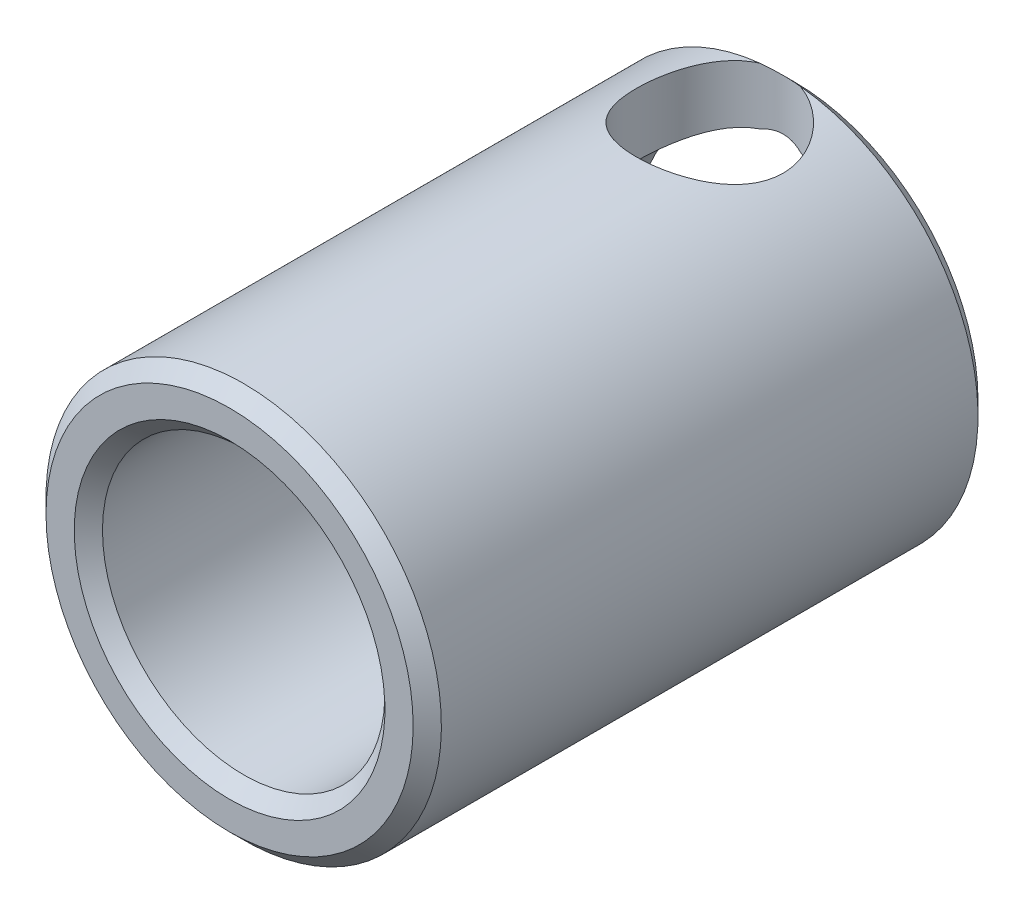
ISO-10303-21;
HEADER;
FILE_DESCRIPTION(('STEP AP214'),'2;1');
FILE_NAME('part.step','',(''),(''),'','','');
FILE_SCHEMA(('AUTOMOTIVE_DESIGN { 1 0 10303 214 1 1 1 1 }'));
ENDSEC;
DATA;
#1=APPLICATION_CONTEXT('core data for automotive mechanical design processes');
#2=APPLICATION_PROTOCOL_DEFINITION('international standard','automotive_design',2000,#1);
#3=PRODUCT_CONTEXT('',#1,'mechanical');
#4=PRODUCT('Part','Part','',(#3));
#5=PRODUCT_RELATED_PRODUCT_CATEGORY('part','',(#4));
#6=PRODUCT_DEFINITION_FORMATION('','',#4);
#7=PRODUCT_DEFINITION_CONTEXT('part definition',#1,'design');
#8=PRODUCT_DEFINITION('design','',#6,#7);
#9=PRODUCT_DEFINITION_SHAPE('','',#8);
#10=(LENGTH_UNIT() NAMED_UNIT(*) SI_UNIT(.MILLI.,.METRE.));
#11=(NAMED_UNIT(*) PLANE_ANGLE_UNIT() SI_UNIT($,.RADIAN.));
#12=(NAMED_UNIT(*) SI_UNIT($,.STERADIAN.) SOLID_ANGLE_UNIT());
#13=UNCERTAINTY_MEASURE_WITH_UNIT(LENGTH_MEASURE(1.E-05),#10,'distance_accuracy_value','');
#14=(GEOMETRIC_REPRESENTATION_CONTEXT(3) GLOBAL_UNCERTAINTY_ASSIGNED_CONTEXT((#13)) GLOBAL_UNIT_ASSIGNED_CONTEXT((#10,
#11,#12)) REPRESENTATION_CONTEXT('',''));
#15=CARTESIAN_POINT('',(0.,0.,0.));
#16=DIRECTION('',(0.,0.,1.));
#17=DIRECTION('',(1.,0.,0.));
#18=AXIS2_PLACEMENT_3D('',#15,#16,#17);
#19=CARTESIAN_POINT('',(0.,0.,20.));
#20=DIRECTION('',(0.,0.,-1.));
#21=DIRECTION('',(-1.,0.,0.));
#22=AXIS2_PLACEMENT_3D('',#19,#20,#21);
#23=CYLINDRICAL_SURFACE('',#22,7.);
#24=CARTESIAN_POINT('',(0.,0.,19.5));
#25=DIRECTION('',(0.,0.,1.));
#26=DIRECTION('',(0.,1.,0.));
#27=AXIS2_PLACEMENT_3D('',#24,#25,#26);
#28=CIRCLE('',#27,7.);
#29=CARTESIAN_POINT('',(0.,7.,19.5));
#30=VERTEX_POINT('',#29);
#31=EDGE_CURVE('E9',#30,#30,#28,.F.);
#32=ORIENTED_EDGE('',*,*,#31,.T.);
#33=EDGE_LOOP('',(#32));
#34=FACE_BOUND('',#33,.T.);
#35=CARTESIAN_POINT('',(0.,7.,0.4));
#36=CARTESIAN_POINT('',(0.140902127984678,7.00000340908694,0.399995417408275));
#37=CARTESIAN_POINT('',(0.281772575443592,6.99570847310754,0.411489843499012));
#38=CARTESIAN_POINT('',(0.559308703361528,6.97900377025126,0.456981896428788));
#39=CARTESIAN_POINT('',(0.69597489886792,6.96659500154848,0.490976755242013));
#40=CARTESIAN_POINT('',(0.961060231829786,6.93499607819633,0.580105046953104));
#41=CARTESIAN_POINT('',(1.08949454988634,6.9158188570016,0.635198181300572));
#42=CARTESIAN_POINT('',(1.33529005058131,6.87259728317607,0.764756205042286));
#43=CARTESIAN_POINT('',(1.45264831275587,6.84855165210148,0.839226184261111));
#44=CARTESIAN_POINT('',(1.67786429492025,6.79695712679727,1.00867578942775));
#45=CARTESIAN_POINT('',(1.78519764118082,6.76931039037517,1.10432230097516));
#46=CARTESIAN_POINT('',(1.98272113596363,6.71411603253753,1.31199410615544));
#47=CARTESIAN_POINT('',(2.07290618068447,6.68656844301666,1.42402425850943));
#48=CARTESIAN_POINT('',(2.23687620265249,6.63355869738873,1.66637033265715));
#49=CARTESIAN_POINT('',(2.309925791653,6.6082123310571,1.79721167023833));
#50=CARTESIAN_POINT('',(2.43275023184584,6.56399417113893,2.07041309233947));
#51=CARTESIAN_POINT('',(2.48253417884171,6.54511984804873,2.21276864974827));
#52=CARTESIAN_POINT('',(2.5553531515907,6.51702746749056,2.49892679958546));
#53=CARTESIAN_POINT('',(2.57938744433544,6.50745015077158,2.64243866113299));
#54=CARTESIAN_POINT('',(2.60314935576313,6.49798380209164,2.93175348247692));
#55=CARTESIAN_POINT('',(2.60288677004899,6.49809086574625,3.07755549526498));
#56=CARTESIAN_POINT('',(2.57882752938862,6.50767095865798,3.35822753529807));
#57=CARTESIAN_POINT('',(2.55640932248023,6.51659539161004,3.49323790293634));
#58=CARTESIAN_POINT('',(2.49095130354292,6.54189421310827,3.75742220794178));
#59=CARTESIAN_POINT('',(2.44790844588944,6.55826970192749,3.88659528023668));
#60=CARTESIAN_POINT('',(2.34165335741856,6.59696112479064,4.13827617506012));
#61=CARTESIAN_POINT('',(2.27807915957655,6.61938237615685,4.26061427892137));
#62=CARTESIAN_POINT('',(2.13281821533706,6.6676031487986,4.49328919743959));
#63=CARTESIAN_POINT('',(2.05112529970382,6.69340381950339,4.60362190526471));
#64=CARTESIAN_POINT('',(1.86561162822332,6.74754880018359,4.81679505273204));
#65=CARTESIAN_POINT('',(1.76068817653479,6.7759487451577,4.9186640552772));
#66=CARTESIAN_POINT('',(1.5349179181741,6.83062982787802,5.10364628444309));
#67=CARTESIAN_POINT('',(1.41406876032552,6.8569106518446,5.18675673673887));
#68=CARTESIAN_POINT('',(1.15743751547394,6.90489731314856,5.3329069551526));
#69=CARTESIAN_POINT('',(1.02145960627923,6.92652907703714,5.39562891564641));
#70=CARTESIAN_POINT('',(0.739879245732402,6.96223204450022,5.49698648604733));
#71=CARTESIAN_POINT('',(0.594281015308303,6.9763065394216,5.5356325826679));
#72=CARTESIAN_POINT('',(0.305773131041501,6.99473357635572,5.58588709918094));
#73=CARTESIAN_POINT('',(0.163121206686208,6.99955613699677,5.59880404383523));
#74=CARTESIAN_POINT('',(-0.122376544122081,7.00038457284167,5.60103632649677));
#75=CARTESIAN_POINT('',(-0.265222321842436,6.99639235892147,5.59035677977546));
#76=CARTESIAN_POINT('',(-0.541435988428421,6.98035004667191,5.54669781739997));
#77=CARTESIAN_POINT('',(-0.674958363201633,6.96860812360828,5.51457074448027));
#78=CARTESIAN_POINT('',(-0.934627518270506,6.93855669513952,5.43004585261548));
#79=CARTESIAN_POINT('',(-1.06077333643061,6.92024633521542,5.37764539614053));
#80=CARTESIAN_POINT('',(-1.30622972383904,6.87820684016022,5.25239914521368));
#81=CARTESIAN_POINT('',(-1.42523360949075,6.85433523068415,5.17900159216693));
#82=CARTESIAN_POINT('',(-1.64963112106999,6.80382009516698,5.01447034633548));
#83=CARTESIAN_POINT('',(-1.75501976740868,6.77717556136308,4.9233301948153));
#84=CARTESIAN_POINT('',(-1.95546470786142,6.72217031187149,4.71979576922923));
#85=CARTESIAN_POINT('',(-2.04959193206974,6.69379820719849,4.60648723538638));
#86=CARTESIAN_POINT('',(-2.21767356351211,6.64001014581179,4.36511926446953));
#87=CARTESIAN_POINT('',(-2.29162634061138,6.61459442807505,4.23705863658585));
#88=CARTESIAN_POINT('',(-2.41728845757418,6.56971904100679,3.96887010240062));
#89=CARTESIAN_POINT('',(-2.46891958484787,6.55028038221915,3.82870179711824));
#90=CARTESIAN_POINT('',(-2.54751642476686,6.52012013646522,3.54073962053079));
#91=CARTESIAN_POINT('',(-2.57449700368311,6.50939329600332,3.39295040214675));
#92=CARTESIAN_POINT('',(-2.60171215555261,6.49856044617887,3.10398712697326));
#93=CARTESIAN_POINT('',(-2.60352712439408,6.49782691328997,2.96298416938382));
#94=CARTESIAN_POINT('',(-2.58439424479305,6.50546005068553,2.68279574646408));
#95=CARTESIAN_POINT('',(-2.56344847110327,6.51382589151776,2.54361011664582));
#96=CARTESIAN_POINT('',(-2.50061005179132,6.53819746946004,2.27515018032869));
#97=CARTESIAN_POINT('',(-2.45935063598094,6.55397162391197,2.14570484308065));
#98=CARTESIAN_POINT('',(-2.35760940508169,6.59125168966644,1.8954955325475));
#99=CARTESIAN_POINT('',(-2.29712277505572,6.61275903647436,1.77473374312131));
#100=CARTESIAN_POINT('',(-2.15501364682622,6.66046565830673,1.53853411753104));
#101=CARTESIAN_POINT('',(-2.07246017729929,6.68685000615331,1.42369421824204));
#102=CARTESIAN_POINT('',(-1.89001350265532,6.74068894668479,1.20899196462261));
#103=CARTESIAN_POINT('',(-1.7901148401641,6.76814387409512,1.10913434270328));
#104=CARTESIAN_POINT('',(-1.5695204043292,6.82276788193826,0.921872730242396));
#105=CARTESIAN_POINT('',(-1.44800627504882,6.84984571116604,0.835401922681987));
#106=CARTESIAN_POINT('',(-1.19122351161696,6.899134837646,0.684144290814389));
#107=CARTESIAN_POINT('',(-1.0559542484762,6.92134591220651,0.619358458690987));
#108=CARTESIAN_POINT('',(-0.770373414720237,6.95901970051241,0.511909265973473));
#109=CARTESIAN_POINT('',(-0.619699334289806,6.97421640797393,0.470107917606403));
#110=CARTESIAN_POINT('',(-0.312668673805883,6.99470230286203,0.414162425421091));
#111=CARTESIAN_POINT('',(-0.156314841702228,6.99999621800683,0.400005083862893));
#112=CARTESIAN_POINT('',(0.,7.,0.4));
#113=B_SPLINE_CURVE_WITH_KNOTS('',3,(#35,#36,#37,#38,#39,#40,#41,#42,#43,#44,#45,#46,#47,#48,
#49,#50,#51,#52,#53,#54,#55,#56,#57,#58,#59,#60,#61,#62,#63,#64,#65,#66,#67,#68,#69,#70,#71,#72,
#73,#74,#75,#76,#77,#78,#79,#80,#81,#82,#83,#84,#85,#86,#87,#88,#89,#90,#91,#92,#93,#94,#95,#96,
#97,#98,#99,#100,#101,#102,#103,#104,#105,#106,#107,#108,#109,#110,#111,#112),.UNSPECIFIED.,.T.,
.F.,(4,2,2,2,2,2,2,2,2,2,2,2,2,2,2,2,2,2,2,2,2,2,2,2,2,2,2,2,2,2,2,2,2,2,2,2,2,2,4),(0.,
0.42212993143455,0.844207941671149,1.26548375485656,1.68687033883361,2.12412948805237,
2.56151857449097,3.01518807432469,3.46868006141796,3.90385364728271,4.33885178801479,
4.74838765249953,5.15798401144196,5.57523654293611,5.99263136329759,6.43750488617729,
6.88244416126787,7.33401897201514,7.78539695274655,8.213164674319,8.64083967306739,
9.05245687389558,9.46412764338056,9.88780578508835,10.3116384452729,10.7595862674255,
11.2075702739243,11.6571114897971,12.1063814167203,12.5272995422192,12.9481793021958,
13.3566987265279,13.7653205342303,14.1950659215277,14.6249467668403,15.0774737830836,
15.5300215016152,15.9985502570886,16.4668552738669),.UNSPECIFIED.);
#114=CARTESIAN_POINT('',(0.714142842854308,6.96347614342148,0.499999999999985));
#115=VERTEX_POINT('',#114);
#116=CARTESIAN_POINT('',(-0.714142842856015,6.96347614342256,0.499999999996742));
#117=VERTEX_POINT('',#116);
#118=EDGE_CURVE('E57',#115,#117,#113,.T.);
#119=ORIENTED_EDGE('',*,*,#118,.T.);
#120=CARTESIAN_POINT('',(0.,0.,0.5));
#121=DIRECTION('',(0.,0.,1.));
#122=DIRECTION('',(0.,1.,0.));
#123=AXIS2_PLACEMENT_3D('',#120,#121,#122);
#124=CIRCLE('',#123,7.);
#125=EDGE_CURVE('E49',#117,#115,#124,.T.);
#126=ORIENTED_EDGE('',*,*,#125,.T.);
#127=EDGE_LOOP('',(#119,#126));
#128=FACE_BOUND('',#127,.T.);
#129=ADVANCED_FACE('F14',(#34,#128),#23,.T.);
#130=CARTESIAN_POINT('',(0.,0.,20.));
#131=DIRECTION('',(0.,0.,-1.));
#132=DIRECTION('',(-1.,0.,0.));
#133=AXIS2_PLACEMENT_3D('',#130,#131,#132);
#134=CYLINDRICAL_SURFACE('',#133,5.);
#135=CARTESIAN_POINT('',(0.,0.,19.5));
#136=DIRECTION('',(0.,0.,1.));
#137=DIRECTION('',(0.,1.,0.));
#138=AXIS2_PLACEMENT_3D('',#135,#136,#137);
#139=CIRCLE('',#138,5.);
#140=CARTESIAN_POINT('',(0.,5.,19.5));
#141=VERTEX_POINT('',#140);
#142=EDGE_CURVE('E105',#141,#141,#139,.T.);
#143=ORIENTED_EDGE('',*,*,#142,.T.);
#144=EDGE_LOOP('',(#143));
#145=FACE_BOUND('',#144,.T.);
#146=CARTESIAN_POINT('',(0.,5.,0.4));
#147=CARTESIAN_POINT('',(-0.136019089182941,4.99999096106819,0.400010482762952));
#148=CARTESIAN_POINT('',(-0.272186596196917,4.9943906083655,0.4107371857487));
#149=CARTESIAN_POINT('',(-0.540451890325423,4.97253564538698,0.453153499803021));
#150=CARTESIAN_POINT('',(-0.672542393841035,4.95626300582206,0.484878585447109));
#151=CARTESIAN_POINT('',(-0.928376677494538,4.91475813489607,0.567691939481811));
#152=CARTESIAN_POINT('',(-1.05215143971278,4.88956163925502,0.618703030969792));
#153=CARTESIAN_POINT('',(-1.28917851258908,4.83248413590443,0.738218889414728));
#154=CARTESIAN_POINT('',(-1.40243111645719,4.80060331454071,0.806723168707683));
#155=CARTESIAN_POINT('',(-1.6233350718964,4.73065003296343,0.964233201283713));
#156=CARTESIAN_POINT('',(-1.73016640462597,4.69231213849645,1.05426908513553));
#157=CARTESIAN_POINT('',(-1.9279784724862,4.61456575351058,1.25006100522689));
#158=CARTESIAN_POINT('',(-2.01894606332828,4.57515640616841,1.35582994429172));
#159=CARTESIAN_POINT('',(-2.19027363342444,4.49581536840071,1.59087447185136));
#160=CARTESIAN_POINT('',(-2.26905938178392,4.45612765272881,1.72138715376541));
#161=CARTESIAN_POINT('',(-2.40325083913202,4.38522502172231,1.99617613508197));
#162=CARTESIAN_POINT('',(-2.45867414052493,4.35400373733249,2.14044197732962));
#163=CARTESIAN_POINT('',(-2.52088783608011,4.31805910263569,2.35934332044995));
#164=CARTESIAN_POINT('',(-2.53788363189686,4.30806297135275,2.4303451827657));
#165=CARTESIAN_POINT('',(-2.56588556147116,4.29144515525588,2.573893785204));
#166=CARTESIAN_POINT('',(-2.5768950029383,4.28482160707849,2.64643964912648));
#167=CARTESIAN_POINT('',(-2.5927366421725,4.27525483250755,2.79239312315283));
#168=CARTESIAN_POINT('',(-2.59757332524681,4.27230893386,2.86580006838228));
#169=CARTESIAN_POINT('',(-2.60100913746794,4.27021647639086,3.01278997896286));
#170=CARTESIAN_POINT('',(-2.59960895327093,4.27106949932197,3.08637292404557));
#171=CARTESIAN_POINT('',(-2.58725154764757,4.27858150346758,3.28692372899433));
#172=CARTESIAN_POINT('',(-2.57003361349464,4.28904261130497,3.41343136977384));
#173=CARTESIAN_POINT('',(-2.51768613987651,4.31997055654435,3.66132802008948));
#174=CARTESIAN_POINT('',(-2.48255005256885,4.34044105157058,3.78271514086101));
#175=CARTESIAN_POINT('',(-2.39479130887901,4.3894811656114,4.0204901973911));
#176=CARTESIAN_POINT('',(-2.34178596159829,4.41822582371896,4.13669954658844));
#177=CARTESIAN_POINT('',(-2.22009489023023,4.48060798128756,4.35914562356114));
#178=CARTESIAN_POINT('',(-2.15140214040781,4.51424767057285,4.46537785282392));
#179=CARTESIAN_POINT('',(-1.98920130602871,4.58825379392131,4.68036630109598));
#180=CARTESIAN_POINT('',(-1.89357317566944,4.6289062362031,4.78743057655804));
#181=CARTESIAN_POINT('',(-1.68563410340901,4.70861352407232,4.9847405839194));
#182=CARTESIAN_POINT('',(-1.57331396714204,4.74766747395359,5.074976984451));
#183=CARTESIAN_POINT('',(-1.32754824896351,4.82233990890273,5.24069874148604));
#184=CARTESIAN_POINT('',(-1.19328929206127,4.8576588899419,5.31512406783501));
#185=CARTESIAN_POINT('',(-0.911861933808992,4.91824712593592,5.43969857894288));
#186=CARTESIAN_POINT('',(-0.764704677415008,4.94352495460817,5.48986848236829));
#187=CARTESIAN_POINT('',(-0.475393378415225,4.97929374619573,5.56011565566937));
#188=CARTESIAN_POINT('',(-0.333920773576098,4.99088129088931,5.58243423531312));
#189=CARTESIAN_POINT('',(-0.0487884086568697,5.00179271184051,5.60346334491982));
#190=CARTESIAN_POINT('',(0.0948701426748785,5.00112313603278,5.60218647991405));
#191=CARTESIAN_POINT('',(0.367236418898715,4.98820101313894,5.57725373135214));
#192=CARTESIAN_POINT('',(0.496174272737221,4.97694124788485,5.55551584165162));
#193=CARTESIAN_POINT('',(0.748282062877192,4.94532303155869,5.49337794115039));
#194=CARTESIAN_POINT('',(0.871451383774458,4.92496361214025,5.45297594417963));
#195=CARTESIAN_POINT('',(1.11236221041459,4.8762860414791,5.3537376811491));
#196=CARTESIAN_POINT('',(1.2298721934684,4.84777059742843,5.29443965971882));
#197=CARTESIAN_POINT('',(1.45363520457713,4.78544216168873,5.15963578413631));
#198=CARTESIAN_POINT('',(1.55988362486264,4.75162701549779,5.08412333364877));
#199=CARTESIAN_POINT('',(1.76985048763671,4.67774151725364,4.91000393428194));
#200=CARTESIAN_POINT('',(1.87215606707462,4.63738638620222,4.8098117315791));
#201=CARTESIAN_POINT('',(2.05919476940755,4.55742087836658,4.59378645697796));
#202=CARTESIAN_POINT('',(2.14391327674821,4.51781114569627,4.47794050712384));
#203=CARTESIAN_POINT('',(2.29820544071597,4.44140795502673,4.2253265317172));
#204=CARTESIAN_POINT('',(2.36657947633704,4.40492186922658,4.08772416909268));
#205=CARTESIAN_POINT('',(2.47848196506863,4.34295670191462,3.80049716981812));
#206=CARTESIAN_POINT('',(2.52204467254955,4.31746245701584,3.65088943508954));
#207=CARTESIAN_POINT('',(2.57887997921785,4.28373374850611,3.35945750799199));
#208=CARTESIAN_POINT('',(2.59469677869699,4.27405597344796,3.21830157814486));
#209=CARTESIAN_POINT('',(2.60304068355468,4.26898360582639,2.93507804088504));
#210=CARTESIAN_POINT('',(2.59558101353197,4.27358090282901,2.79301099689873));
#211=CARTESIAN_POINT('',(2.5600068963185,4.29496218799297,2.52864778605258));
#212=CARTESIAN_POINT('',(2.53426764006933,4.31034237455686,2.40590252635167));
#213=CARTESIAN_POINT('',(2.46597470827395,4.34977173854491,2.16666044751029));
#214=CARTESIAN_POINT('',(2.42341519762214,4.37382392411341,2.05016581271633));
#215=CARTESIAN_POINT('',(2.31958522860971,4.42980935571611,1.81816485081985));
#216=CARTESIAN_POINT('',(2.25726457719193,4.46215821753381,1.70323202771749));
#217=CARTESIAN_POINT('',(2.11677400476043,4.53049358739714,1.48468929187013));
#218=CARTESIAN_POINT('',(2.03859558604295,4.56648204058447,1.38108549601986));
#219=CARTESIAN_POINT('',(1.85623996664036,4.64386036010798,1.17354687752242));
#220=CARTESIAN_POINT('',(1.74997688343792,4.68532277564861,1.07146035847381));
#221=CARTESIAN_POINT('',(1.52087135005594,4.76462705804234,0.886071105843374));
#222=CARTESIAN_POINT('',(1.39801904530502,4.80246674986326,0.802779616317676));
#223=CARTESIAN_POINT('',(1.13593024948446,4.87116249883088,0.656393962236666));
#224=CARTESIAN_POINT('',(0.996453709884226,4.90189090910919,0.59366162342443));
#225=CARTESIAN_POINT('',(0.779573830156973,4.93940131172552,0.518440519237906));
#226=CARTESIAN_POINT('',(0.706053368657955,4.95046999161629,0.496521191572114));
#227=CARTESIAN_POINT('',(0.55699204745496,4.96944514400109,0.459203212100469));
#228=CARTESIAN_POINT('',(0.481452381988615,4.97735344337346,0.443800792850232));
#229=CARTESIAN_POINT('',(0.338395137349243,4.98898678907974,0.421227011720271));
#230=CARTESIAN_POINT('',(0.271031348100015,4.99310623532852,0.413277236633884));
#231=CARTESIAN_POINT('',(0.135790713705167,4.9986151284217,0.40266105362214));
#232=CARTESIAN_POINT('',(0.0679138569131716,5.00000451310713,0.399994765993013));
#233=CARTESIAN_POINT('',(0.,5.,0.4));
#234=B_SPLINE_CURVE_WITH_KNOTS('',3,(#146,#147,#148,#149,#150,#151,#152,#153,#154,#155,#156,
#157,#158,#159,#160,#161,#162,#163,#164,#165,#166,#167,#168,#169,#170,#171,#172,#173,#174,#175,
#176,#177,#178,#179,#180,#181,#182,#183,#184,#185,#186,#187,#188,#189,#190,#191,#192,#193,#194,
#195,#196,#197,#198,#199,#200,#201,#202,#203,#204,#205,#206,#207,#208,#209,#210,#211,#212,#213,
#214,#215,#216,#217,#218,#219,#220,#221,#222,#223,#224,#225,#226,#227,#228,#229,#230,#231,#232,
#233),.UNSPECIFIED.,.T.,.F.,(4,2,2,2,2,2,2,2,2,2,2,2,2,2,2,2,2,2,2,2,2,2,2,2,2,2,2,2,2,2,2,2,2,
2,2,2,2,2,2,2,2,2,2,4),(0.,0.407793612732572,0.816277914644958,1.22314459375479,
1.62999993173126,2.06284652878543,2.49605008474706,2.96633035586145,3.43625586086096,
3.6570450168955,3.87771205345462,4.09821865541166,4.3187009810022,4.70102335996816,
5.08348555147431,5.47472236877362,5.86613474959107,6.31181217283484,6.7577360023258,
7.22774598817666,7.69735378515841,8.12604002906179,8.55449726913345,8.94641141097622,
9.3383672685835,9.74074892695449,10.1432945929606,10.5877141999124,11.0325016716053,
11.5037289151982,11.9743039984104,12.3988893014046,12.8232334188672,13.2006541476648,
13.5782059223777,13.9806951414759,14.3834006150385,14.8405414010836,15.2979549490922,
15.7630332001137,15.9952701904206,16.2273727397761,16.4309780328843,16.6345879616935),.UNSPECIFIED.);
#235=CARTESIAN_POINT('',(-0.7141428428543,4.94873721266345,0.5));
#236=VERTEX_POINT('',#235);
#237=CARTESIAN_POINT('',(0.714142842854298,4.94873721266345,0.5));
#238=VERTEX_POINT('',#237);
#239=EDGE_CURVE('E53',#236,#238,#234,.T.);
#240=ORIENTED_EDGE('',*,*,#239,.T.);
#241=CARTESIAN_POINT('',(0.,0.,0.5));
#242=DIRECTION('',(0.,0.,1.));
#243=DIRECTION('',(0.,1.,0.));
#244=AXIS2_PLACEMENT_3D('',#241,#242,#243);
#245=CIRCLE('',#244,5.);
#246=EDGE_CURVE('E45',#238,#236,#245,.F.);
#247=ORIENTED_EDGE('',*,*,#246,.T.);
#248=EDGE_LOOP('',(#240,#247));
#249=FACE_BOUND('',#248,.T.);
#250=ADVANCED_FACE('F52',(#145,#249),#134,.F.);
#251=CARTESIAN_POINT('',(0.,0.,20.));
#252=DIRECTION('',(0.,0.,1.));
#253=DIRECTION('',(1.,0.,0.));
#254=AXIS2_PLACEMENT_3D('',#251,#252,#253);
#255=PLANE('',#254);
#256=CARTESIAN_POINT('',(0.,0.,20.));
#257=DIRECTION('',(0.,0.,1.));
#258=DIRECTION('',(0.,1.,0.));
#259=AXIS2_PLACEMENT_3D('',#256,#257,#258);
#260=CIRCLE('',#259,5.5);
#261=CARTESIAN_POINT('',(0.,5.5,20.));
#262=VERTEX_POINT('',#261);
#263=EDGE_CURVE('E22',#262,#262,#260,.F.);
#264=ORIENTED_EDGE('',*,*,#263,.T.);
#265=EDGE_LOOP('',(#264));
#266=FACE_BOUND('',#265,.T.);
#267=CARTESIAN_POINT('',(0.,0.,20.));
#268=DIRECTION('',(0.,0.,1.));
#269=DIRECTION('',(0.,1.,0.));
#270=AXIS2_PLACEMENT_3D('',#267,#268,#269);
#271=CIRCLE('',#270,6.5);
#272=CARTESIAN_POINT('',(0.,6.5,20.));
#273=VERTEX_POINT('',#272);
#274=EDGE_CURVE('E108',#273,#273,#271,.T.);
#275=ORIENTED_EDGE('',*,*,#274,.T.);
#276=EDGE_LOOP('',(#275));
#277=FACE_BOUND('',#276,.T.);
#278=ADVANCED_FACE('F113',(#266,#277),#255,.T.);
#279=CARTESIAN_POINT('',(0.,0.,0.));
#280=DIRECTION('',(0.,0.,1.));
#281=DIRECTION('',(1.,0.,0.));
#282=AXIS2_PLACEMENT_3D('',#279,#280,#281);
#283=PLANE('',#282);
#284=CARTESIAN_POINT('',(0.,0.,0.));
#285=DIRECTION('',(0.,0.,1.));
#286=DIRECTION('',(0.,1.,0.));
#287=AXIS2_PLACEMENT_3D('',#284,#285,#286);
#288=CIRCLE('',#287,6.5);
#289=CARTESIAN_POINT('',(0.,6.5,0.));
#290=VERTEX_POINT('',#289);
#291=EDGE_CURVE('E102',#290,#290,#288,.F.);
#292=ORIENTED_EDGE('',*,*,#291,.T.);
#293=EDGE_LOOP('',(#292));
#294=FACE_BOUND('',#293,.T.);
#295=CARTESIAN_POINT('',(0.,0.,0.));
#296=DIRECTION('',(0.,0.,1.));
#297=DIRECTION('',(0.,1.,0.));
#298=AXIS2_PLACEMENT_3D('',#295,#296,#297);
#299=CIRCLE('',#298,5.5);
#300=CARTESIAN_POINT('',(0.,5.5,0.));
#301=VERTEX_POINT('',#300);
#302=EDGE_CURVE('E54',#301,#301,#299,.T.);
#303=ORIENTED_EDGE('',*,*,#302,.T.);
#304=EDGE_LOOP('',(#303));
#305=FACE_BOUND('',#304,.T.);
#306=ADVANCED_FACE('F75',(#294,#305),#283,.F.);
#307=CARTESIAN_POINT('',(0.,7.001,3.));
#308=DIRECTION('',(0.,-1.,0.));
#309=DIRECTION('',(0.,0.,-1.));
#310=AXIS2_PLACEMENT_3D('',#307,#308,#309);
#311=CYLINDRICAL_SURFACE('',#310,2.6);
#312=ORIENTED_EDGE('',*,*,#239,.F.);
#313=CARTESIAN_POINT('',(-0.714142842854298,4.94873721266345,0.5));
#314=CARTESIAN_POINT('',(-0.675500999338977,4.96546569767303,0.488961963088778));
#315=CARTESIAN_POINT('',(-0.636141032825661,4.9810245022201,0.478688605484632));
#316=CARTESIAN_POINT('',(-0.556070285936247,5.00957688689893,0.459826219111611));
#317=CARTESIAN_POINT('',(-0.515358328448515,5.02256815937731,0.451238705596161));
#318=CARTESIAN_POINT('',(-0.391681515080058,5.05723830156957,0.428312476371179));
#319=CARTESIAN_POINT('',(-0.306937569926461,5.07471883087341,0.416740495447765));
#320=CARTESIAN_POINT('',(-0.134545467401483,5.09692982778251,0.402034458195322));
#321=CARTESIAN_POINT('',(-0.0468829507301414,5.10158326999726,0.398951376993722));
#322=CARTESIAN_POINT('',(0.127989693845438,5.09746167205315,0.401681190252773));
#323=CARTESIAN_POINT('',(0.215199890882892,5.08868874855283,0.407492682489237));
#324=CARTESIAN_POINT('',(0.372692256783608,5.06098702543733,0.42582884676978));
#325=CARTESIAN_POINT('',(0.443460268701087,5.04389593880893,0.437138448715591));
#326=CARTESIAN_POINT('',(0.58160383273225,5.00190585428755,0.464896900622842));
#327=CARTESIAN_POINT('',(0.648979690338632,4.97700756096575,0.481345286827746));
#328=CARTESIAN_POINT('',(0.714142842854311,4.9487372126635,0.499999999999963));
#329=B_SPLINE_CURVE_WITH_KNOTS('',3,(#313,#314,#315,#316,#317,#318,#319,#320,#321,#322,#323,
#324,#325,#326,#327,#328),.UNSPECIFIED.,.F.,.F.,(4,2,2,2,2,2,2,4),(0.,0.130541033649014,
0.2611988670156,0.521715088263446,0.783792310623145,1.04582822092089,1.26617733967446,
1.48650657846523),.UNSPECIFIED.);
#330=EDGE_CURVE('E41',#236,#238,#329,.T.);
#331=ORIENTED_EDGE('',*,*,#330,.T.);
#332=EDGE_LOOP('',(#312,#331));
#333=FACE_BOUND('',#332,.T.);
#334=ORIENTED_EDGE('',*,*,#118,.F.);
#335=CARTESIAN_POINT('',(0.714142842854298,6.96347614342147,0.5));
#336=CARTESIAN_POINT('',(0.654310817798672,6.95242947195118,0.482897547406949));
#337=CARTESIAN_POINT('',(0.593612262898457,6.94282765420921,0.467892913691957));
#338=CARTESIAN_POINT('',(0.470919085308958,6.92650900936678,0.442237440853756));
#339=CARTESIAN_POINT('',(0.408924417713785,6.91979228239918,0.431586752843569));
#340=CARTESIAN_POINT('',(0.28576411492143,6.90938219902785,0.415024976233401));
#341=CARTESIAN_POINT('',(0.22462122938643,6.90561217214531,0.408993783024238));
#342=CARTESIAN_POINT('',(0.101981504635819,6.90079213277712,0.401273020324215));
#343=CARTESIAN_POINT('',(0.040484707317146,6.89974180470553,0.399582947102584));
#344=CARTESIAN_POINT('',(-0.137138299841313,6.9006403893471,0.401032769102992));
#345=CARTESIAN_POINT('',(-0.253296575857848,6.90607960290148,0.409792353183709));
#346=CARTESIAN_POINT('',(-0.426594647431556,6.92165943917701,0.434543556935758));
#347=CARTESIAN_POINT('',(-0.484954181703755,6.92822543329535,0.444943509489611));
#348=CARTESIAN_POINT('',(-0.600502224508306,6.94392412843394,0.469608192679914));
#349=CARTESIAN_POINT('',(-0.657690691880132,6.9530569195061,0.483873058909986));
#350=CARTESIAN_POINT('',(-0.714142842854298,6.96347614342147,0.5));
#351=B_SPLINE_CURVE_WITH_KNOTS('',3,(#335,#336,#337,#338,#339,#340,#341,#342,#343,#344,#345,
#346,#347,#348,#349,#350),.UNSPECIFIED.,.F.,.F.,(4,2,2,2,2,2,2,4),(0.,0.189546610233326,
0.379099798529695,0.563539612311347,0.747958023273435,1.09609240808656,1.27485844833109,
1.45363076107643),.UNSPECIFIED.);
#352=EDGE_CURVE('E28',#115,#117,#351,.T.);
#353=ORIENTED_EDGE('',*,*,#352,.T.);
#354=EDGE_LOOP('',(#334,#353));
#355=FACE_BOUND('',#354,.T.);
#356=ADVANCED_FACE('F56',(#333,#355),#311,.F.);
#357=CARTESIAN_POINT('',(0.,0.,0.));
#358=DIRECTION('',(0.,0.,-1.));
#359=DIRECTION('',(0.,-1.,0.));
#360=AXIS2_PLACEMENT_3D('',#357,#358,#359);
#361=CONICAL_SURFACE('',#360,5.5,0.785398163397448);
#362=ORIENTED_EDGE('',*,*,#330,.F.);
#363=ORIENTED_EDGE('',*,*,#246,.F.);
#364=EDGE_LOOP('',(#362,#363));
#365=FACE_BOUND('',#364,.T.);
#366=ORIENTED_EDGE('',*,*,#302,.F.);
#367=EDGE_LOOP('',(#366));
#368=FACE_BOUND('',#367,.T.);
#369=ADVANCED_FACE('F43',(#365,#368),#361,.F.);
#370=CARTESIAN_POINT('',(0.,0.,0.5));
#371=DIRECTION('',(0.,0.,1.));
#372=DIRECTION('',(0.,1.,0.));
#373=AXIS2_PLACEMENT_3D('',#370,#371,#372);
#374=CONICAL_SURFACE('',#373,7.,0.785398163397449);
#375=ORIENTED_EDGE('',*,*,#291,.F.);
#376=EDGE_LOOP('',(#375));
#377=FACE_BOUND('',#376,.T.);
#378=ORIENTED_EDGE('',*,*,#352,.F.);
#379=ORIENTED_EDGE('',*,*,#125,.F.);
#380=EDGE_LOOP('',(#378,#379));
#381=FACE_BOUND('',#380,.T.);
#382=ADVANCED_FACE('F91',(#377,#381),#374,.T.);
#383=CARTESIAN_POINT('',(0.,0.,19.5));
#384=DIRECTION('',(0.,0.,1.));
#385=DIRECTION('',(0.,1.,0.));
#386=AXIS2_PLACEMENT_3D('',#383,#384,#385);
#387=CONICAL_SURFACE('',#386,5.,0.785398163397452);
#388=ORIENTED_EDGE('',*,*,#263,.F.);
#389=EDGE_LOOP('',(#388));
#390=FACE_BOUND('',#389,.T.);
#391=ORIENTED_EDGE('',*,*,#142,.F.);
#392=EDGE_LOOP('',(#391));
#393=FACE_BOUND('',#392,.T.);
#394=ADVANCED_FACE('F95',(#390,#393),#387,.F.);
#395=CARTESIAN_POINT('',(0.,0.,20.));
#396=DIRECTION('',(0.,0.,-1.));
#397=DIRECTION('',(0.,-1.,0.));
#398=AXIS2_PLACEMENT_3D('',#395,#396,#397);
#399=CONICAL_SURFACE('',#398,6.5,0.785398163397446);
#400=ORIENTED_EDGE('',*,*,#31,.F.);
#401=EDGE_LOOP('',(#400));
#402=FACE_BOUND('',#401,.T.);
#403=ORIENTED_EDGE('',*,*,#274,.F.);
#404=EDGE_LOOP('',(#403));
#405=FACE_BOUND('',#404,.T.);
#406=ADVANCED_FACE('F16',(#402,#405),#399,.T.);
#407=CLOSED_SHELL('',(#129,#250,#278,#306,#356,#369,#382,#394,#406));
#408=MANIFOLD_SOLID_BREP('B1',#407);
#409=ADVANCED_BREP_SHAPE_REPRESENTATION('',(#18,#408),#14);
#410=SHAPE_DEFINITION_REPRESENTATION(#9,#409);
ENDSEC;
END-ISO-10303-21;
